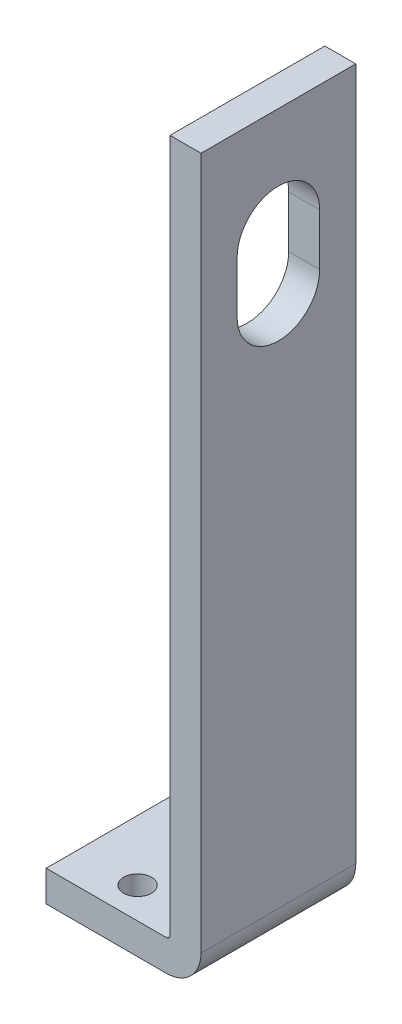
ISO-10303-21;
HEADER;
FILE_DESCRIPTION(('STEP AP214'),'2;1');
FILE_NAME('part.step','',(''),(''),'','','');
FILE_SCHEMA(('AUTOMOTIVE_DESIGN { 1 0 10303 214 1 1 1 1 }'));
ENDSEC;
DATA;
#1=APPLICATION_CONTEXT('core data for automotive mechanical design processes');
#2=APPLICATION_PROTOCOL_DEFINITION('international standard','automotive_design',2000,#1);
#3=PRODUCT_CONTEXT('',#1,'mechanical');
#4=PRODUCT('Part','Part','',(#3));
#5=PRODUCT_RELATED_PRODUCT_CATEGORY('part','',(#4));
#6=PRODUCT_DEFINITION_FORMATION('','',#4);
#7=PRODUCT_DEFINITION_CONTEXT('part definition',#1,'design');
#8=PRODUCT_DEFINITION('design','',#6,#7);
#9=PRODUCT_DEFINITION_SHAPE('','',#8);
#10=(LENGTH_UNIT() NAMED_UNIT(*) SI_UNIT(.MILLI.,.METRE.));
#11=(NAMED_UNIT(*) PLANE_ANGLE_UNIT() SI_UNIT($,.RADIAN.));
#12=(NAMED_UNIT(*) SI_UNIT($,.STERADIAN.) SOLID_ANGLE_UNIT());
#13=UNCERTAINTY_MEASURE_WITH_UNIT(LENGTH_MEASURE(1.E-05),#10,'distance_accuracy_value','');
#14=(GEOMETRIC_REPRESENTATION_CONTEXT(3) GLOBAL_UNCERTAINTY_ASSIGNED_CONTEXT((#13)) GLOBAL_UNIT_ASSIGNED_CONTEXT((#10,
#11,#12)) REPRESENTATION_CONTEXT('',''));
#15=CARTESIAN_POINT('',(0.,0.,0.));
#16=DIRECTION('',(0.,0.,1.));
#17=DIRECTION('',(1.,0.,0.));
#18=AXIS2_PLACEMENT_3D('',#15,#16,#17);
#19=CARTESIAN_POINT('',(0.,0.,30.));
#20=DIRECTION('',(0.,1.,0.));
#21=DIRECTION('',(0.,0.,1.));
#22=AXIS2_PLACEMENT_3D('',#19,#20,#21);
#23=PLANE('',#22);
#24=DIRECTION('',(-1.,0.,0.));
#25=VECTOR('',#24,1.);
#26=CARTESIAN_POINT('',(0.,0.,18.));
#27=LINE('',#26,#25);
#28=CARTESIAN_POINT('',(23.2634,0.,18.));
#29=VERTEX_POINT('',#28);
#30=CARTESIAN_POINT('',(13.2503066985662,0.,18.));
#31=VERTEX_POINT('',#30);
#32=EDGE_CURVE('E127',#29,#31,#27,.T.);
#33=ORIENTED_EDGE('',*,*,#32,.T.);
#34=DIRECTION('',(0.,0.,1.));
#35=VECTOR('',#34,1.);
#36=CARTESIAN_POINT('',(13.2503066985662,0.,12.));
#37=LINE('',#36,#35);
#38=CARTESIAN_POINT('',(13.2503066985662,0.,12.));
#39=VERTEX_POINT('',#38);
#40=EDGE_CURVE('E138',#39,#31,#37,.T.);
#41=ORIENTED_EDGE('',*,*,#40,.F.);
#42=DIRECTION('',(-1.,0.,0.));
#43=VECTOR('',#42,1.);
#44=CARTESIAN_POINT('',(0.,0.,12.));
#45=LINE('',#44,#43);
#46=CARTESIAN_POINT('',(23.2634,0.,12.));
#47=VERTEX_POINT('',#46);
#48=EDGE_CURVE('E161',#47,#39,#45,.T.);
#49=ORIENTED_EDGE('',*,*,#48,.F.);
#50=DIRECTION('',(0.,0.,-1.));
#51=VECTOR('',#50,1.);
#52=CARTESIAN_POINT('',(23.2634,0.,30.));
#53=LINE('',#52,#51);
#54=CARTESIAN_POINT('',(23.2634,0.,0.));
#55=VERTEX_POINT('',#54);
#56=EDGE_CURVE('E146',#47,#55,#53,.T.);
#57=ORIENTED_EDGE('',*,*,#56,.T.);
#58=DIRECTION('',(-1.,0.,0.));
#59=VECTOR('',#58,1.);
#60=CARTESIAN_POINT('',(30.,0.,0.));
#61=LINE('',#60,#59);
#62=CARTESIAN_POINT('',(0.,0.,0.));
#63=VERTEX_POINT('',#62);
#64=EDGE_CURVE('E162',#63,#55,#61,.F.);
#65=ORIENTED_EDGE('',*,*,#64,.F.);
#66=DIRECTION('',(0.,0.,1.));
#67=VECTOR('',#66,1.);
#68=CARTESIAN_POINT('',(0.,0.,30.));
#69=LINE('',#68,#67);
#70=CARTESIAN_POINT('',(0.,0.,30.));
#71=VERTEX_POINT('',#70);
#72=EDGE_CURVE('E175',#71,#63,#69,.F.);
#73=ORIENTED_EDGE('',*,*,#72,.F.);
#74=DIRECTION('',(-1.,0.,0.));
#75=VECTOR('',#74,1.);
#76=CARTESIAN_POINT('',(23.2634,0.,30.));
#77=LINE('',#76,#75);
#78=CARTESIAN_POINT('',(23.2634,0.,30.));
#79=VERTEX_POINT('',#78);
#80=EDGE_CURVE('E151',#71,#79,#77,.F.);
#81=ORIENTED_EDGE('',*,*,#80,.T.);
#82=DIRECTION('',(0.,0.,-1.));
#83=VECTOR('',#82,1.);
#84=CARTESIAN_POINT('',(23.2634,0.,30.));
#85=LINE('',#84,#83);
#86=EDGE_CURVE('E143',#79,#29,#85,.T.);
#87=ORIENTED_EDGE('',*,*,#86,.T.);
#88=EDGE_LOOP('',(#33,#41,#49,#57,#65,#73,#81,#87));
#89=FACE_BOUND('',#88,.T.);
#90=CARTESIAN_POINT('',(11.92634,0.,6.));
#91=DIRECTION('',(0.,1.,0.));
#92=DIRECTION('',(0.,0.,1.));
#93=AXIS2_PLACEMENT_3D('',#90,#91,#92);
#94=CIRCLE('',#93,2.7);
#95=CARTESIAN_POINT('',(11.92634,0.,8.7));
#96=VERTEX_POINT('',#95);
#97=EDGE_CURVE('E183',#96,#96,#94,.F.);
#98=ORIENTED_EDGE('',*,*,#97,.T.);
#99=EDGE_LOOP('',(#98));
#100=FACE_BOUND('',#99,.T.);
#101=CARTESIAN_POINT('',(11.70536,0.,24.));
#102=DIRECTION('',(0.,1.,0.));
#103=DIRECTION('',(0.,0.,1.));
#104=AXIS2_PLACEMENT_3D('',#101,#102,#103);
#105=CIRCLE('',#104,2.7);
#106=CARTESIAN_POINT('',(11.70536,0.,26.7));
#107=VERTEX_POINT('',#106);
#108=EDGE_CURVE('E20',#107,#107,#105,.F.);
#109=ORIENTED_EDGE('',*,*,#108,.T.);
#110=EDGE_LOOP('',(#109));
#111=FACE_BOUND('',#110,.T.);
#112=ADVANCED_FACE('F17',(#89,#100,#111),#23,.T.);
#113=CARTESIAN_POINT('',(11.70536,-6.,24.));
#114=DIRECTION('',(0.,1.,0.));
#115=DIRECTION('',(0.,0.,1.));
#116=AXIS2_PLACEMENT_3D('',#113,#114,#115);
#117=CYLINDRICAL_SURFACE('',#116,2.7);
#118=CARTESIAN_POINT('',(11.70536,-6.,24.));
#119=DIRECTION('',(0.,1.,0.));
#120=DIRECTION('',(0.,0.,1.));
#121=AXIS2_PLACEMENT_3D('',#118,#119,#120);
#122=CIRCLE('',#121,2.7);
#123=CARTESIAN_POINT('',(11.70536,-6.,26.7));
#124=VERTEX_POINT('',#123);
#125=EDGE_CURVE('E216',#124,#124,#122,.F.);
#126=ORIENTED_EDGE('',*,*,#125,.T.);
#127=EDGE_LOOP('',(#126));
#128=FACE_BOUND('',#127,.T.);
#129=ORIENTED_EDGE('',*,*,#108,.F.);
#130=EDGE_LOOP('',(#129));
#131=FACE_BOUND('',#130,.T.);
#132=ADVANCED_FACE('F227',(#128,#131),#117,.F.);
#133=CARTESIAN_POINT('',(11.92634,-6.,6.));
#134=DIRECTION('',(0.,1.,0.));
#135=DIRECTION('',(0.,0.,1.));
#136=AXIS2_PLACEMENT_3D('',#133,#134,#135);
#137=CYLINDRICAL_SURFACE('',#136,2.7);
#138=CARTESIAN_POINT('',(11.92634,-6.,6.));
#139=DIRECTION('',(0.,1.,0.));
#140=DIRECTION('',(0.,0.,1.));
#141=AXIS2_PLACEMENT_3D('',#138,#139,#140);
#142=CIRCLE('',#141,2.7);
#143=CARTESIAN_POINT('',(11.92634,-6.,8.7));
#144=VERTEX_POINT('',#143);
#145=EDGE_CURVE('E169',#144,#144,#142,.F.);
#146=ORIENTED_EDGE('',*,*,#145,.T.);
#147=EDGE_LOOP('',(#146));
#148=FACE_BOUND('',#147,.T.);
#149=ORIENTED_EDGE('',*,*,#97,.F.);
#150=EDGE_LOOP('',(#149));
#151=FACE_BOUND('',#150,.T.);
#152=ADVANCED_FACE('F229',(#148,#151),#137,.F.);
#153=CARTESIAN_POINT('',(0.,-6.,30.));
#154=DIRECTION('',(-1.,0.,0.));
#155=DIRECTION('',(0.,0.,1.));
#156=AXIS2_PLACEMENT_3D('',#153,#154,#155);
#157=PLANE('',#156);
#158=DIRECTION('',(0.,1.,0.));
#159=VECTOR('',#158,1.);
#160=CARTESIAN_POINT('',(0.,0.7366,30.));
#161=LINE('',#160,#159);
#162=CARTESIAN_POINT('',(0.,-6.,30.));
#163=VERTEX_POINT('',#162);
#164=EDGE_CURVE('E172',#163,#71,#161,.T.);
#165=ORIENTED_EDGE('',*,*,#164,.T.);
#166=ORIENTED_EDGE('',*,*,#72,.T.);
#167=DIRECTION('',(0.,1.,0.));
#168=VECTOR('',#167,1.);
#169=CARTESIAN_POINT('',(0.,0.7366,0.));
#170=LINE('',#169,#168);
#171=CARTESIAN_POINT('',(0.,-6.,0.));
#172=VERTEX_POINT('',#171);
#173=EDGE_CURVE('E158',#172,#63,#170,.T.);
#174=ORIENTED_EDGE('',*,*,#173,.F.);
#175=DIRECTION('',(0.,0.,1.));
#176=VECTOR('',#175,1.);
#177=CARTESIAN_POINT('',(0.,-6.,30.));
#178=LINE('',#177,#176);
#179=EDGE_CURVE('E165',#172,#163,#178,.T.);
#180=ORIENTED_EDGE('',*,*,#179,.T.);
#181=EDGE_LOOP('',(#165,#166,#174,#180));
#182=FACE_BOUND('',#181,.T.);
#183=ADVANCED_FACE('F236',(#182),#157,.T.);
#184=CARTESIAN_POINT('',(0.,0.,12.));
#185=DIRECTION('',(0.,0.,-1.));
#186=DIRECTION('',(-1.,0.,0.));
#187=AXIS2_PLACEMENT_3D('',#184,#185,#186);
#188=PLANE('',#187);
#189=CARTESIAN_POINT('',(23.2634,0.7366,12.));
#190=DIRECTION('',(0.,0.,-1.));
#191=DIRECTION('',(-1.,0.,0.));
#192=AXIS2_PLACEMENT_3D('',#189,#190,#191);
#193=CIRCLE('',#192,0.7366);
#194=CARTESIAN_POINT('',(24.,0.7366,12.));
#195=VERTEX_POINT('',#194);
#196=EDGE_CURVE('E219',#195,#47,#193,.T.);
#197=ORIENTED_EDGE('',*,*,#196,.T.);
#198=ORIENTED_EDGE('',*,*,#48,.T.);
#199=DIRECTION('',(-0.220570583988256,-0.975371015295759,0.));
#200=VECTOR('',#199,1.);
#201=CARTESIAN_POINT('',(13.2503066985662,0.,12.));
#202=LINE('',#201,#200);
#203=CARTESIAN_POINT('',(24.,47.5355284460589,12.));
#204=VERTEX_POINT('',#203);
#205=EDGE_CURVE('E179',#204,#39,#202,.T.);
#206=ORIENTED_EDGE('',*,*,#205,.F.);
#207=DIRECTION('',(0.,1.,0.));
#208=VECTOR('',#207,1.);
#209=CARTESIAN_POINT('',(24.,0.,12.));
#210=LINE('',#209,#208);
#211=EDGE_CURVE('E210',#195,#204,#210,.T.);
#212=ORIENTED_EDGE('',*,*,#211,.F.);
#213=EDGE_LOOP('',(#197,#198,#206,#212));
#214=FACE_BOUND('',#213,.T.);
#215=ADVANCED_FACE('F298',(#214),#188,.T.);
#216=CARTESIAN_POINT('',(13.2503066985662,0.,12.));
#217=DIRECTION('',(-0.975371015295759,0.220570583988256,0.));
#218=DIRECTION('',(-0.220570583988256,-0.975371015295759,0.));
#219=AXIS2_PLACEMENT_3D('',#216,#217,#218);
#220=PLANE('',#219);
#221=ORIENTED_EDGE('',*,*,#205,.T.);
#222=ORIENTED_EDGE('',*,*,#40,.T.);
#223=DIRECTION('',(0.220570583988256,0.975371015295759,0.));
#224=VECTOR('',#223,1.);
#225=CARTESIAN_POINT('',(13.2503066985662,0.,18.));
#226=LINE('',#225,#224);
#227=CARTESIAN_POINT('',(24.,47.5355284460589,18.));
#228=VERTEX_POINT('',#227);
#229=EDGE_CURVE('E134',#31,#228,#226,.T.);
#230=ORIENTED_EDGE('',*,*,#229,.T.);
#231=DIRECTION('',(0.,0.,1.));
#232=VECTOR('',#231,1.);
#233=CARTESIAN_POINT('',(24.,47.5355284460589,30.));
#234=LINE('',#233,#232);
#235=EDGE_CURVE('E333',#204,#228,#234,.T.);
#236=ORIENTED_EDGE('',*,*,#235,.F.);
#237=EDGE_LOOP('',(#221,#222,#230,#236));
#238=FACE_BOUND('',#237,.T.);
#239=ADVANCED_FACE('F295',(#238),#220,.T.);
#240=CARTESIAN_POINT('',(0.,0.,18.));
#241=DIRECTION('',(0.,0.,-1.));
#242=DIRECTION('',(-1.,0.,0.));
#243=AXIS2_PLACEMENT_3D('',#240,#241,#242);
#244=PLANE('',#243);
#245=ORIENTED_EDGE('',*,*,#229,.F.);
#246=ORIENTED_EDGE('',*,*,#32,.F.);
#247=CARTESIAN_POINT('',(23.2634,0.7366,18.));
#248=DIRECTION('',(0.,0.,-1.));
#249=DIRECTION('',(-1.,0.,0.));
#250=AXIS2_PLACEMENT_3D('',#247,#248,#249);
#251=CIRCLE('',#250,0.7366);
#252=CARTESIAN_POINT('',(24.,0.7366,18.));
#253=VERTEX_POINT('',#252);
#254=EDGE_CURVE('E131',#29,#253,#251,.F.);
#255=ORIENTED_EDGE('',*,*,#254,.T.);
#256=DIRECTION('',(0.,1.,0.));
#257=VECTOR('',#256,1.);
#258=CARTESIAN_POINT('',(24.,0.,18.));
#259=LINE('',#258,#257);
#260=EDGE_CURVE('E336',#228,#253,#259,.F.);
#261=ORIENTED_EDGE('',*,*,#260,.F.);
#262=EDGE_LOOP('',(#245,#246,#255,#261));
#263=FACE_BOUND('',#262,.T.);
#264=ADVANCED_FACE('F129',(#263),#244,.F.);
#265=CARTESIAN_POINT('',(23.2634,0.7366,30.));
#266=DIRECTION('',(0.,0.,-1.));
#267=DIRECTION('',(-1.,0.,0.));
#268=AXIS2_PLACEMENT_3D('',#265,#266,#267);
#269=CYLINDRICAL_SURFACE('',#268,0.7366);
#270=ORIENTED_EDGE('',*,*,#254,.F.);
#271=ORIENTED_EDGE('',*,*,#86,.F.);
#272=CARTESIAN_POINT('',(23.2634,0.7366,30.));
#273=DIRECTION('',(0.,0.,-1.));
#274=DIRECTION('',(-1.,0.,0.));
#275=AXIS2_PLACEMENT_3D('',#272,#273,#274);
#276=CIRCLE('',#275,0.7366);
#277=CARTESIAN_POINT('',(24.,0.7366,30.));
#278=VERTEX_POINT('',#277);
#279=EDGE_CURVE('E211',#278,#79,#276,.T.);
#280=ORIENTED_EDGE('',*,*,#279,.F.);
#281=DIRECTION('',(0.,0.,1.));
#282=VECTOR('',#281,1.);
#283=CARTESIAN_POINT('',(24.,0.7366,30.));
#284=LINE('',#283,#282);
#285=EDGE_CURVE('E145',#253,#278,#284,.T.);
#286=ORIENTED_EDGE('',*,*,#285,.F.);
#287=EDGE_LOOP('',(#270,#271,#280,#286));
#288=FACE_BOUND('',#287,.T.);
#289=ADVANCED_FACE('F141',(#288),#269,.F.);
#290=CARTESIAN_POINT('',(23.2634,0.7366,30.));
#291=DIRECTION('',(0.,0.,-1.));
#292=DIRECTION('',(-1.,0.,0.));
#293=AXIS2_PLACEMENT_3D('',#290,#291,#292);
#294=CYLINDRICAL_SURFACE('',#293,0.7366);
#295=DIRECTION('',(0.,0.,1.));
#296=VECTOR('',#295,1.);
#297=CARTESIAN_POINT('',(24.,0.7366,30.));
#298=LINE('',#297,#296);
#299=CARTESIAN_POINT('',(24.,0.7366,0.));
#300=VERTEX_POINT('',#299);
#301=EDGE_CURVE('E207',#300,#195,#298,.T.);
#302=ORIENTED_EDGE('',*,*,#301,.F.);
#303=CARTESIAN_POINT('',(23.2634,0.7366,0.));
#304=DIRECTION('',(0.,0.,-1.));
#305=DIRECTION('',(-1.,0.,0.));
#306=AXIS2_PLACEMENT_3D('',#303,#304,#305);
#307=CIRCLE('',#306,0.7366);
#308=EDGE_CURVE('E208',#55,#300,#307,.F.);
#309=ORIENTED_EDGE('',*,*,#308,.F.);
#310=ORIENTED_EDGE('',*,*,#56,.F.);
#311=ORIENTED_EDGE('',*,*,#196,.F.);
#312=EDGE_LOOP('',(#302,#309,#310,#311));
#313=FACE_BOUND('',#312,.T.);
#314=ADVANCED_FACE('F286',(#313),#294,.F.);
#315=CARTESIAN_POINT('',(0.,-6.,30.));
#316=DIRECTION('',(0.,1.,0.));
#317=DIRECTION('',(0.,0.,1.));
#318=AXIS2_PLACEMENT_3D('',#315,#316,#317);
#319=PLANE('',#318);
#320=DIRECTION('',(0.,0.,-1.));
#321=VECTOR('',#320,1.);
#322=CARTESIAN_POINT('',(23.2634,-6.,30.));
#323=LINE('',#322,#321);
#324=CARTESIAN_POINT('',(23.2634,-6.,30.));
#325=VERTEX_POINT('',#324);
#326=CARTESIAN_POINT('',(23.2634,-6.,0.));
#327=VERTEX_POINT('',#326);
#328=EDGE_CURVE('E196',#325,#327,#323,.T.);
#329=ORIENTED_EDGE('',*,*,#328,.F.);
#330=DIRECTION('',(1.,0.,0.));
#331=VECTOR('',#330,1.);
#332=CARTESIAN_POINT('',(0.,-6.,30.));
#333=LINE('',#332,#331);
#334=EDGE_CURVE('E168',#163,#325,#333,.T.);
#335=ORIENTED_EDGE('',*,*,#334,.F.);
#336=ORIENTED_EDGE('',*,*,#179,.F.);
#337=DIRECTION('',(1.,0.,0.));
#338=VECTOR('',#337,1.);
#339=CARTESIAN_POINT('',(0.,-6.,0.));
#340=LINE('',#339,#338);
#341=EDGE_CURVE('E213',#327,#172,#340,.F.);
#342=ORIENTED_EDGE('',*,*,#341,.F.);
#343=EDGE_LOOP('',(#329,#335,#336,#342));
#344=FACE_BOUND('',#343,.T.);
#345=ORIENTED_EDGE('',*,*,#145,.F.);
#346=EDGE_LOOP('',(#345));
#347=FACE_BOUND('',#346,.T.);
#348=ORIENTED_EDGE('',*,*,#125,.F.);
#349=EDGE_LOOP('',(#348));
#350=FACE_BOUND('',#349,.T.);
#351=ADVANCED_FACE('F282',(#344,#347,#350),#319,.F.);
#352=CARTESIAN_POINT('',(24.,0.,30.));
#353=DIRECTION('',(-1.,0.,0.));
#354=DIRECTION('',(0.,0.,1.));
#355=AXIS2_PLACEMENT_3D('',#352,#353,#354);
#356=PLANE('',#355);
#357=DIRECTION('',(0.,1.,0.));
#358=VECTOR('',#357,1.);
#359=CARTESIAN_POINT('',(24.,0.7366,0.));
#360=LINE('',#359,#358);
#361=CARTESIAN_POINT('',(24.,135.,0.));
#362=VERTEX_POINT('',#361);
#363=EDGE_CURVE('E368',#300,#362,#360,.T.);
#364=ORIENTED_EDGE('',*,*,#363,.F.);
#365=ORIENTED_EDGE('',*,*,#301,.T.);
#366=ORIENTED_EDGE('',*,*,#211,.T.);
#367=ORIENTED_EDGE('',*,*,#235,.T.);
#368=ORIENTED_EDGE('',*,*,#260,.T.);
#369=ORIENTED_EDGE('',*,*,#285,.T.);
#370=DIRECTION('',(0.,1.,0.));
#371=VECTOR('',#370,1.);
#372=CARTESIAN_POINT('',(24.,-6.,30.));
#373=LINE('',#372,#371);
#374=CARTESIAN_POINT('',(24.,135.,30.));
#375=VERTEX_POINT('',#374);
#376=EDGE_CURVE('E323',#375,#278,#373,.F.);
#377=ORIENTED_EDGE('',*,*,#376,.F.);
#378=DIRECTION('',(0.,0.,1.));
#379=VECTOR('',#378,1.);
#380=CARTESIAN_POINT('',(24.,135.,30.));
#381=LINE('',#380,#379);
#382=EDGE_CURVE('E371',#362,#375,#381,.T.);
#383=ORIENTED_EDGE('',*,*,#382,.F.);
#384=EDGE_LOOP('',(#364,#365,#366,#367,#368,#369,#377,#383));
#385=FACE_BOUND('',#384,.T.);
#386=CARTESIAN_POINT('',(24.,104.,15.));
#387=DIRECTION('',(-1.,0.,0.));
#388=DIRECTION('',(0.,0.,1.));
#389=AXIS2_PLACEMENT_3D('',#386,#387,#388);
#390=CIRCLE('',#389,8.);
#391=CARTESIAN_POINT('',(24.,104.,23.));
#392=VERTEX_POINT('',#391);
#393=CARTESIAN_POINT('',(24.,104.,7.));
#394=VERTEX_POINT('',#393);
#395=EDGE_CURVE('E204',#392,#394,#390,.F.);
#396=ORIENTED_EDGE('',*,*,#395,.T.);
#397=DIRECTION('',(0.,1.,0.));
#398=VECTOR('',#397,1.);
#399=CARTESIAN_POINT('',(24.,114.,7.00000000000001));
#400=LINE('',#399,#398);
#401=CARTESIAN_POINT('',(24.,114.,7.00000000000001));
#402=VERTEX_POINT('',#401);
#403=EDGE_CURVE('E330',#394,#402,#400,.T.);
#404=ORIENTED_EDGE('',*,*,#403,.T.);
#405=CARTESIAN_POINT('',(24.,114.,15.));
#406=DIRECTION('',(-1.,0.,0.));
#407=DIRECTION('',(0.,0.,1.));
#408=AXIS2_PLACEMENT_3D('',#405,#406,#407);
#409=CIRCLE('',#408,8.);
#410=CARTESIAN_POINT('',(24.,114.,23.));
#411=VERTEX_POINT('',#410);
#412=EDGE_CURVE('E200',#402,#411,#409,.F.);
#413=ORIENTED_EDGE('',*,*,#412,.T.);
#414=DIRECTION('',(0.,-1.,0.));
#415=VECTOR('',#414,1.);
#416=CARTESIAN_POINT('',(24.,114.,23.));
#417=LINE('',#416,#415);
#418=EDGE_CURVE('E199',#411,#392,#417,.T.);
#419=ORIENTED_EDGE('',*,*,#418,.T.);
#420=EDGE_LOOP('',(#396,#404,#413,#419));
#421=FACE_BOUND('',#420,.T.);
#422=ADVANCED_FACE('F278',(#385,#421),#356,.T.);
#423=CARTESIAN_POINT('',(30.,104.,15.));
#424=DIRECTION('',(-1.,0.,0.));
#425=DIRECTION('',(0.,0.,1.));
#426=AXIS2_PLACEMENT_3D('',#423,#424,#425);
#427=CYLINDRICAL_SURFACE('',#426,8.);
#428=DIRECTION('',(1.,0.,0.));
#429=VECTOR('',#428,1.);
#430=CARTESIAN_POINT('',(30.,104.,23.));
#431=LINE('',#430,#429);
#432=CARTESIAN_POINT('',(30.,104.,23.));
#433=VERTEX_POINT('',#432);
#434=EDGE_CURVE('E202',#392,#433,#431,.T.);
#435=ORIENTED_EDGE('',*,*,#434,.T.);
#436=CARTESIAN_POINT('',(30.,104.,15.));
#437=DIRECTION('',(-1.,0.,0.));
#438=DIRECTION('',(0.,0.,1.));
#439=AXIS2_PLACEMENT_3D('',#436,#437,#438);
#440=CIRCLE('',#439,8.);
#441=CARTESIAN_POINT('',(30.,104.,7.));
#442=VERTEX_POINT('',#441);
#443=EDGE_CURVE('E191',#433,#442,#440,.F.);
#444=ORIENTED_EDGE('',*,*,#443,.T.);
#445=DIRECTION('',(1.,0.,0.));
#446=VECTOR('',#445,1.);
#447=CARTESIAN_POINT('',(30.,104.,7.));
#448=LINE('',#447,#446);
#449=EDGE_CURVE('E206',#442,#394,#448,.F.);
#450=ORIENTED_EDGE('',*,*,#449,.T.);
#451=ORIENTED_EDGE('',*,*,#395,.F.);
#452=EDGE_LOOP('',(#435,#444,#450,#451));
#453=FACE_BOUND('',#452,.T.);
#454=ADVANCED_FACE('F274',(#453),#427,.F.);
#455=CARTESIAN_POINT('',(30.,114.,7.00000000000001));
#456=DIRECTION('',(0.,0.,-1.));
#457=DIRECTION('',(0.,1.,0.));
#458=AXIS2_PLACEMENT_3D('',#455,#456,#457);
#459=PLANE('',#458);
#460=ORIENTED_EDGE('',*,*,#449,.F.);
#461=DIRECTION('',(0.,1.,0.));
#462=VECTOR('',#461,1.);
#463=CARTESIAN_POINT('',(30.,0.,7.00000000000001));
#464=LINE('',#463,#462);
#465=CARTESIAN_POINT('',(30.,114.,7.00000000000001));
#466=VERTEX_POINT('',#465);
#467=EDGE_CURVE('E190',#442,#466,#464,.T.);
#468=ORIENTED_EDGE('',*,*,#467,.T.);
#469=DIRECTION('',(-1.,0.,0.));
#470=VECTOR('',#469,1.);
#471=CARTESIAN_POINT('',(30.,114.,7.00000000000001));
#472=LINE('',#471,#470);
#473=EDGE_CURVE('E203',#466,#402,#472,.T.);
#474=ORIENTED_EDGE('',*,*,#473,.T.);
#475=ORIENTED_EDGE('',*,*,#403,.F.);
#476=EDGE_LOOP('',(#460,#468,#474,#475));
#477=FACE_BOUND('',#476,.T.);
#478=ADVANCED_FACE('F270',(#477),#459,.F.);
#479=CARTESIAN_POINT('',(30.,114.,15.));
#480=DIRECTION('',(-1.,0.,0.));
#481=DIRECTION('',(0.,0.,1.));
#482=AXIS2_PLACEMENT_3D('',#479,#480,#481);
#483=CYLINDRICAL_SURFACE('',#482,8.);
#484=ORIENTED_EDGE('',*,*,#473,.F.);
#485=CARTESIAN_POINT('',(30.,114.,15.));
#486=DIRECTION('',(-1.,0.,0.));
#487=DIRECTION('',(0.,0.,1.));
#488=AXIS2_PLACEMENT_3D('',#485,#486,#487);
#489=CIRCLE('',#488,8.);
#490=CARTESIAN_POINT('',(30.,114.,23.));
#491=VERTEX_POINT('',#490);
#492=EDGE_CURVE('E186',#466,#491,#489,.F.);
#493=ORIENTED_EDGE('',*,*,#492,.T.);
#494=DIRECTION('',(1.,0.,0.));
#495=VECTOR('',#494,1.);
#496=CARTESIAN_POINT('',(30.,114.,23.));
#497=LINE('',#496,#495);
#498=EDGE_CURVE('E329',#491,#411,#497,.F.);
#499=ORIENTED_EDGE('',*,*,#498,.T.);
#500=ORIENTED_EDGE('',*,*,#412,.F.);
#501=EDGE_LOOP('',(#484,#493,#499,#500));
#502=FACE_BOUND('',#501,.T.);
#503=ADVANCED_FACE('F266',(#502),#483,.F.);
#504=CARTESIAN_POINT('',(30.,114.,23.));
#505=DIRECTION('',(0.,0.,1.));
#506=DIRECTION('',(0.,-1.,0.));
#507=AXIS2_PLACEMENT_3D('',#504,#505,#506);
#508=PLANE('',#507);
#509=ORIENTED_EDGE('',*,*,#498,.F.);
#510=DIRECTION('',(0.,1.,0.));
#511=VECTOR('',#510,1.);
#512=CARTESIAN_POINT('',(30.,0.,23.));
#513=LINE('',#512,#511);
#514=EDGE_CURVE('E189',#491,#433,#513,.F.);
#515=ORIENTED_EDGE('',*,*,#514,.T.);
#516=ORIENTED_EDGE('',*,*,#434,.F.);
#517=ORIENTED_EDGE('',*,*,#418,.F.);
#518=EDGE_LOOP('',(#509,#515,#516,#517));
#519=FACE_BOUND('',#518,.T.);
#520=ADVANCED_FACE('F262',(#519),#508,.F.);
#521=CARTESIAN_POINT('',(23.2634,0.7366,30.));
#522=DIRECTION('',(0.,0.,-1.));
#523=DIRECTION('',(-1.,0.,0.));
#524=AXIS2_PLACEMENT_3D('',#521,#522,#523);
#525=CYLINDRICAL_SURFACE('',#524,6.7366);
#526=CARTESIAN_POINT('',(23.2634,0.7366,30.));
#527=DIRECTION('',(0.,0.,-1.));
#528=DIRECTION('',(-1.,0.,0.));
#529=AXIS2_PLACEMENT_3D('',#526,#527,#528);
#530=CIRCLE('',#529,6.7366);
#531=CARTESIAN_POINT('',(30.,0.7366,30.));
#532=VERTEX_POINT('',#531);
#533=EDGE_CURVE('E194',#532,#325,#530,.T.);
#534=ORIENTED_EDGE('',*,*,#533,.T.);
#535=ORIENTED_EDGE('',*,*,#328,.T.);
#536=CARTESIAN_POINT('',(23.2634,0.7366,0.));
#537=DIRECTION('',(0.,0.,-1.));
#538=DIRECTION('',(-1.,0.,0.));
#539=AXIS2_PLACEMENT_3D('',#536,#537,#538);
#540=CIRCLE('',#539,6.7366);
#541=CARTESIAN_POINT('',(30.,0.7366,0.));
#542=VERTEX_POINT('',#541);
#543=EDGE_CURVE('E197',#327,#542,#540,.F.);
#544=ORIENTED_EDGE('',*,*,#543,.T.);
#545=DIRECTION('',(0.,0.,1.));
#546=VECTOR('',#545,1.);
#547=CARTESIAN_POINT('',(30.,0.7366,30.));
#548=LINE('',#547,#546);
#549=EDGE_CURVE('E382',#542,#532,#548,.T.);
#550=ORIENTED_EDGE('',*,*,#549,.T.);
#551=EDGE_LOOP('',(#534,#535,#544,#550));
#552=FACE_BOUND('',#551,.T.);
#553=ADVANCED_FACE('F258',(#552),#525,.T.);
#554=CARTESIAN_POINT('',(23.2634,-6.,30.));
#555=DIRECTION('',(0.,0.,1.));
#556=DIRECTION('',(1.,0.,0.));
#557=AXIS2_PLACEMENT_3D('',#554,#555,#556);
#558=PLANE('',#557);
#559=DIRECTION('',(0.,1.,0.));
#560=VECTOR('',#559,1.);
#561=CARTESIAN_POINT('',(30.,0.,30.));
#562=LINE('',#561,#560);
#563=CARTESIAN_POINT('',(30.,135.,30.));
#564=VERTEX_POINT('',#563);
#565=EDGE_CURVE('E380',#532,#564,#562,.T.);
#566=ORIENTED_EDGE('',*,*,#565,.T.);
#567=DIRECTION('',(1.,0.,0.));
#568=VECTOR('',#567,1.);
#569=CARTESIAN_POINT('',(24.,135.,30.));
#570=LINE('',#569,#568);
#571=EDGE_CURVE('E372',#375,#564,#570,.T.);
#572=ORIENTED_EDGE('',*,*,#571,.F.);
#573=ORIENTED_EDGE('',*,*,#376,.T.);
#574=ORIENTED_EDGE('',*,*,#279,.T.);
#575=ORIENTED_EDGE('',*,*,#80,.F.);
#576=ORIENTED_EDGE('',*,*,#164,.F.);
#577=ORIENTED_EDGE('',*,*,#334,.T.);
#578=ORIENTED_EDGE('',*,*,#533,.F.);
#579=EDGE_LOOP('',(#566,#572,#573,#574,#575,#576,#577,#578));
#580=FACE_BOUND('',#579,.T.);
#581=ADVANCED_FACE('F254',(#580),#558,.T.);
#582=CARTESIAN_POINT('',(24.,135.,30.));
#583=DIRECTION('',(0.,1.,0.));
#584=DIRECTION('',(0.,0.,1.));
#585=AXIS2_PLACEMENT_3D('',#582,#583,#584);
#586=PLANE('',#585);
#587=ORIENTED_EDGE('',*,*,#571,.T.);
#588=DIRECTION('',(0.,0.,1.));
#589=VECTOR('',#588,1.);
#590=CARTESIAN_POINT('',(30.,135.,30.));
#591=LINE('',#590,#589);
#592=CARTESIAN_POINT('',(30.,135.,0.));
#593=VERTEX_POINT('',#592);
#594=EDGE_CURVE('E26',#564,#593,#591,.F.);
#595=ORIENTED_EDGE('',*,*,#594,.T.);
#596=DIRECTION('',(-1.,0.,0.));
#597=VECTOR('',#596,1.);
#598=CARTESIAN_POINT('',(23.2634,135.,0.));
#599=LINE('',#598,#597);
#600=EDGE_CURVE('E34',#362,#593,#599,.F.);
#601=ORIENTED_EDGE('',*,*,#600,.F.);
#602=ORIENTED_EDGE('',*,*,#382,.T.);
#603=EDGE_LOOP('',(#587,#595,#601,#602));
#604=FACE_BOUND('',#603,.T.);
#605=ADVANCED_FACE('F247',(#604),#586,.T.);
#606=CARTESIAN_POINT('',(23.2634,0.7366,0.));
#607=DIRECTION('',(0.,0.,-1.));
#608=DIRECTION('',(-1.,0.,0.));
#609=AXIS2_PLACEMENT_3D('',#606,#607,#608);
#610=PLANE('',#609);
#611=ORIENTED_EDGE('',*,*,#363,.T.);
#612=ORIENTED_EDGE('',*,*,#600,.T.);
#613=DIRECTION('',(0.,1.,0.));
#614=VECTOR('',#613,1.);
#615=CARTESIAN_POINT('',(30.,0.,0.));
#616=LINE('',#615,#614);
#617=EDGE_CURVE('E11',#593,#542,#616,.F.);
#618=ORIENTED_EDGE('',*,*,#617,.T.);
#619=ORIENTED_EDGE('',*,*,#543,.F.);
#620=ORIENTED_EDGE('',*,*,#341,.T.);
#621=ORIENTED_EDGE('',*,*,#173,.T.);
#622=ORIENTED_EDGE('',*,*,#64,.T.);
#623=ORIENTED_EDGE('',*,*,#308,.T.);
#624=EDGE_LOOP('',(#611,#612,#618,#619,#620,#621,#622,#623));
#625=FACE_BOUND('',#624,.T.);
#626=ADVANCED_FACE('F241',(#625),#610,.T.);
#627=CARTESIAN_POINT('',(30.,0.,30.));
#628=DIRECTION('',(-1.,0.,0.));
#629=DIRECTION('',(0.,0.,1.));
#630=AXIS2_PLACEMENT_3D('',#627,#628,#629);
#631=PLANE('',#630);
#632=ORIENTED_EDGE('',*,*,#594,.F.);
#633=ORIENTED_EDGE('',*,*,#565,.F.);
#634=ORIENTED_EDGE('',*,*,#549,.F.);
#635=ORIENTED_EDGE('',*,*,#617,.F.);
#636=EDGE_LOOP('',(#632,#633,#634,#635));
#637=FACE_BOUND('',#636,.T.);
#638=ORIENTED_EDGE('',*,*,#492,.F.);
#639=ORIENTED_EDGE('',*,*,#467,.F.);
#640=ORIENTED_EDGE('',*,*,#443,.F.);
#641=ORIENTED_EDGE('',*,*,#514,.F.);
#642=EDGE_LOOP('',(#638,#639,#640,#641));
#643=FACE_BOUND('',#642,.T.);
#644=ADVANCED_FACE('F239',(#637,#643),#631,.F.);
#645=CLOSED_SHELL('',(#112,#132,#152,#183,#215,#239,#264,#289,#314,#351,#422,#454,#478,#503,
#520,#553,#581,#605,#626,#644));
#646=MANIFOLD_SOLID_BREP('B1',#645);
#647=ADVANCED_BREP_SHAPE_REPRESENTATION('',(#18,#646),#14);
#648=SHAPE_DEFINITION_REPRESENTATION(#9,#647);
ENDSEC;
END-ISO-10303-21;
